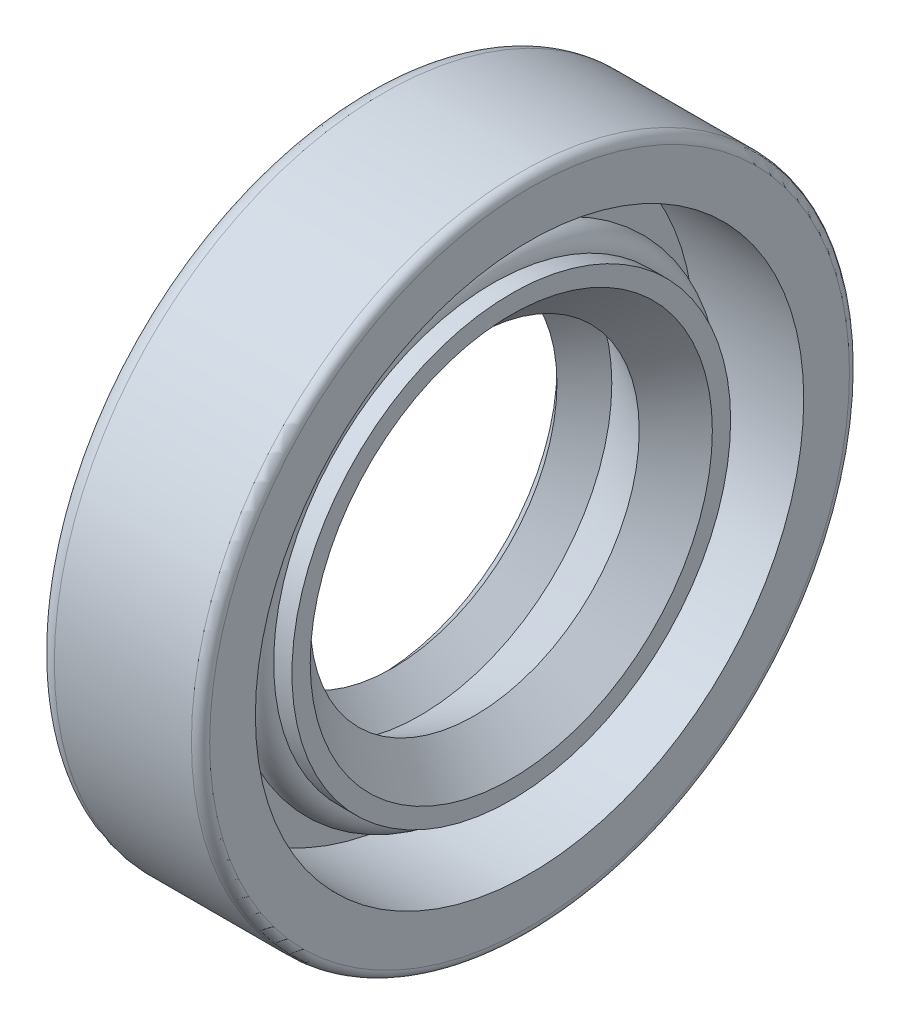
from build123d import *


with BuildPart() as part:
    # Schizzo1 → Rivoluzione1 (revolve)
    with BuildSketch(Plane.XY, mode=Mode.PRIVATE) as rivoluzione1_sk:
        with BuildLine():
            Line((0, 18.888888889), (0, 16.666666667))
            Line((0, 16.666666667), (0.2, 16.666666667))
            Line((0.2, 16.666666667), (0.2, 13.333333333))
            Line((0.2, 13.333333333), (0, 13.333333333))
            Line((0, 13.333333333), (0, 12.5))
            Line((0, 12.5), (1.666666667, 11.666666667))
            Line((1.666666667, 11.666666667), (0.833333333, 10.833333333))
            Line((0.833333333, 10.833333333), (1.666666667, 10))
            Line((1.666666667, 10), (3.333333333, 11.666666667))
            Line((3.333333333, 11.666666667), (6.666666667, 10))
            Line((6.666666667, 10), (8.888888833, 12.222222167))
            Line((8.888888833, 12.222222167), (8.888888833, 13.333333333))
            Line((8.888888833, 13.333333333), (7.777777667, 13.333333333))
            ThreePointArc((7.777777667, 13.333333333), (6.666666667, 14.444444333), (5.555555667, 13.333333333))
            Line((5.555555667, 13.333333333), (3.888888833, 13.333333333))
            ThreePointArc((3.888888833, 13.333333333), (3.496051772, 13.496051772), (3.333333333, 13.888888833))
            Line((3.333333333, 13.888888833), (3.333333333, 16.666666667))
            Line((3.333333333, 16.666666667), (10, 16.666666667))
            Line((10, 16.666666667), (10, 19.444444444))
            ThreePointArc((10, 19.444444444), (9.837281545, 19.837281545), (9.444444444, 20))
            Line((9.444444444, 20), (1.111111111, 20))
            ThreePointArc((1.111111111, 20), (0.32543691, 19.67456309), (0, 18.888888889))
        make_face()
    revolve(rivoluzione1_sk.sketch.rotate(Axis((0, 0, 0), (-1, 0, 0)), 90), axis=Axis((0, 0, 0), (-1, 0, 0)))


solid = part.part
